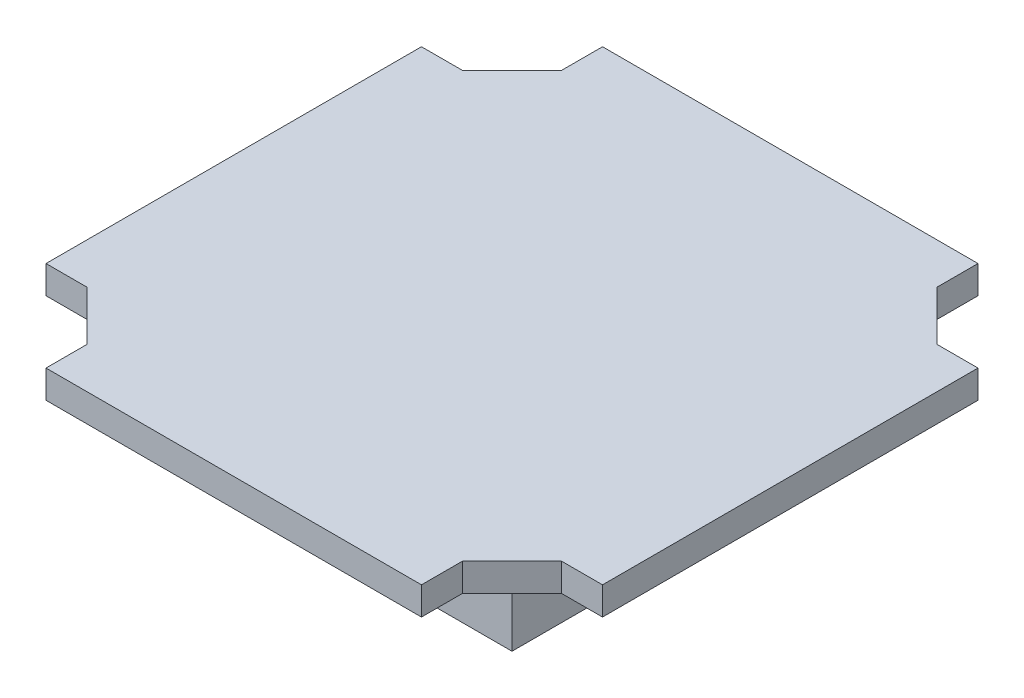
ISO-10303-21;
HEADER;
FILE_DESCRIPTION(('STEP AP214'),'2;1');
FILE_NAME('part.step','',(''),(''),'','','');
FILE_SCHEMA(('AUTOMOTIVE_DESIGN { 1 0 10303 214 1 1 1 1 }'));
ENDSEC;
DATA;
#1=APPLICATION_CONTEXT('core data for automotive mechanical design processes');
#2=APPLICATION_PROTOCOL_DEFINITION('international standard','automotive_design',2000,#1);
#3=PRODUCT_CONTEXT('',#1,'mechanical');
#4=PRODUCT('Part','Part','',(#3));
#5=PRODUCT_RELATED_PRODUCT_CATEGORY('part','',(#4));
#6=PRODUCT_DEFINITION_FORMATION('','',#4);
#7=PRODUCT_DEFINITION_CONTEXT('part definition',#1,'design');
#8=PRODUCT_DEFINITION('design','',#6,#7);
#9=PRODUCT_DEFINITION_SHAPE('','',#8);
#10=(LENGTH_UNIT() NAMED_UNIT(*) SI_UNIT(.MILLI.,.METRE.));
#11=(NAMED_UNIT(*) PLANE_ANGLE_UNIT() SI_UNIT($,.RADIAN.));
#12=(NAMED_UNIT(*) SI_UNIT($,.STERADIAN.) SOLID_ANGLE_UNIT());
#13=UNCERTAINTY_MEASURE_WITH_UNIT(LENGTH_MEASURE(1.E-05),#10,'distance_accuracy_value','');
#14=(GEOMETRIC_REPRESENTATION_CONTEXT(3) GLOBAL_UNCERTAINTY_ASSIGNED_CONTEXT((#13)) GLOBAL_UNIT_ASSIGNED_CONTEXT((#10,
#11,#12)) REPRESENTATION_CONTEXT('',''));
#15=CARTESIAN_POINT('',(0.,0.,0.));
#16=DIRECTION('',(0.,0.,1.));
#17=DIRECTION('',(1.,0.,0.));
#18=AXIS2_PLACEMENT_3D('',#15,#16,#17);
#19=CARTESIAN_POINT('',(-19.0196847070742,2.5,19.0196847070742));
#20=DIRECTION('',(0.707106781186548,0.,-0.707106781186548));
#21=DIRECTION('',(-0.707106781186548,0.,-0.707106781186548));
#22=AXIS2_PLACEMENT_3D('',#19,#20,#21);
#23=PLANE('',#22);
#24=DIRECTION('',(0.707106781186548,0.,0.707106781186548));
#25=VECTOR('',#24,1.);
#26=CARTESIAN_POINT('',(-19.0196847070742,0.,19.0196847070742));
#27=LINE('',#26,#25);
#28=CARTESIAN_POINT('',(-21.24,0.,16.7993694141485));
#29=VERTEX_POINT('',#28);
#30=CARTESIAN_POINT('',(-16.7993694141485,0.,21.24));
#31=VERTEX_POINT('',#30);
#32=EDGE_CURVE('E779',#29,#31,#27,.T.);
#33=ORIENTED_EDGE('',*,*,#32,.T.);
#34=DIRECTION('',(0.,-1.,0.));
#35=VECTOR('',#34,1.);
#36=CARTESIAN_POINT('',(-16.7993694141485,2.5,21.24));
#37=LINE('',#36,#35);
#38=CARTESIAN_POINT('',(-16.7993694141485,2.5,21.24));
#39=VERTEX_POINT('',#38);
#40=EDGE_CURVE('E12',#39,#31,#37,.T.);
#41=ORIENTED_EDGE('',*,*,#40,.F.);
#42=DIRECTION('',(0.707106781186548,0.,0.707106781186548));
#43=VECTOR('',#42,1.);
#44=CARTESIAN_POINT('',(-19.0196847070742,2.5,19.0196847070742));
#45=LINE('',#44,#43);
#46=CARTESIAN_POINT('',(-21.24,2.5,16.7993694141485));
#47=VERTEX_POINT('',#46);
#48=EDGE_CURVE('E790',#47,#39,#45,.T.);
#49=ORIENTED_EDGE('',*,*,#48,.F.);
#50=DIRECTION('',(0.,-1.,0.));
#51=VECTOR('',#50,1.);
#52=CARTESIAN_POINT('',(-21.24,2.5,16.7993694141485));
#53=LINE('',#52,#51);
#54=EDGE_CURVE('E842',#47,#29,#53,.T.);
#55=ORIENTED_EDGE('',*,*,#54,.T.);
#56=EDGE_LOOP('',(#33,#41,#49,#55));
#57=FACE_BOUND('',#56,.T.);
#58=ADVANCED_FACE('F221',(#57),#23,.F.);
#59=CARTESIAN_POINT('',(-16.7993694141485,2.5,0.));
#60=DIRECTION('',(1.,0.,0.));
#61=DIRECTION('',(0.,0.,-1.));
#62=AXIS2_PLACEMENT_3D('',#59,#60,#61);
#63=PLANE('',#62);
#64=DIRECTION('',(0.,0.,1.));
#65=VECTOR('',#64,1.);
#66=CARTESIAN_POINT('',(-16.7993694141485,0.,0.));
#67=LINE('',#66,#65);
#68=CARTESIAN_POINT('',(-16.7993694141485,0.,24.9));
#69=VERTEX_POINT('',#68);
#70=EDGE_CURVE('E846',#31,#69,#67,.T.);
#71=ORIENTED_EDGE('',*,*,#70,.T.);
#72=DIRECTION('',(0.,-1.,0.));
#73=VECTOR('',#72,1.);
#74=CARTESIAN_POINT('',(-16.7993694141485,2.5,24.9));
#75=LINE('',#74,#73);
#76=CARTESIAN_POINT('',(-16.7993694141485,2.5,24.9));
#77=VERTEX_POINT('',#76);
#78=EDGE_CURVE('E229',#77,#69,#75,.T.);
#79=ORIENTED_EDGE('',*,*,#78,.F.);
#80=DIRECTION('',(0.,0.,1.));
#81=VECTOR('',#80,1.);
#82=CARTESIAN_POINT('',(-16.7993694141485,2.5,0.));
#83=LINE('',#82,#81);
#84=EDGE_CURVE('E794',#39,#77,#83,.T.);
#85=ORIENTED_EDGE('',*,*,#84,.F.);
#86=ORIENTED_EDGE('',*,*,#40,.T.);
#87=EDGE_LOOP('',(#71,#79,#85,#86));
#88=FACE_BOUND('',#87,.T.);
#89=ADVANCED_FACE('F973',(#88),#63,.F.);
#90=CARTESIAN_POINT('',(0.,2.5,24.9));
#91=DIRECTION('',(0.,0.,-1.));
#92=DIRECTION('',(-1.,0.,0.));
#93=AXIS2_PLACEMENT_3D('',#90,#91,#92);
#94=PLANE('',#93);
#95=DIRECTION('',(1.,0.,0.));
#96=VECTOR('',#95,1.);
#97=CARTESIAN_POINT('',(0.,0.,24.9));
#98=LINE('',#97,#96);
#99=CARTESIAN_POINT('',(16.7993694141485,0.,24.9));
#100=VERTEX_POINT('',#99);
#101=EDGE_CURVE('E849',#69,#100,#98,.T.);
#102=ORIENTED_EDGE('',*,*,#101,.T.);
#103=DIRECTION('',(0.,-1.,0.));
#104=VECTOR('',#103,1.);
#105=CARTESIAN_POINT('',(16.7993694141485,2.5,24.9));
#106=LINE('',#105,#104);
#107=CARTESIAN_POINT('',(16.7993694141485,2.5,24.9));
#108=VERTEX_POINT('',#107);
#109=EDGE_CURVE('E941',#108,#100,#106,.T.);
#110=ORIENTED_EDGE('',*,*,#109,.F.);
#111=DIRECTION('',(1.,0.,0.));
#112=VECTOR('',#111,1.);
#113=CARTESIAN_POINT('',(0.,2.5,24.9));
#114=LINE('',#113,#112);
#115=EDGE_CURVE('E798',#77,#108,#114,.T.);
#116=ORIENTED_EDGE('',*,*,#115,.F.);
#117=ORIENTED_EDGE('',*,*,#78,.T.);
#118=EDGE_LOOP('',(#102,#110,#116,#117));
#119=FACE_BOUND('',#118,.T.);
#120=ADVANCED_FACE('F950',(#119),#94,.F.);
#121=CARTESIAN_POINT('',(16.7993694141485,2.5,0.));
#122=DIRECTION('',(-1.,0.,0.));
#123=DIRECTION('',(0.,0.,1.));
#124=AXIS2_PLACEMENT_3D('',#121,#122,#123);
#125=PLANE('',#124);
#126=DIRECTION('',(0.,0.,-1.));
#127=VECTOR('',#126,1.);
#128=CARTESIAN_POINT('',(16.7993694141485,0.,0.));
#129=LINE('',#128,#127);
#130=CARTESIAN_POINT('',(16.7993694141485,0.,21.24));
#131=VERTEX_POINT('',#130);
#132=EDGE_CURVE('E852',#100,#131,#129,.T.);
#133=ORIENTED_EDGE('',*,*,#132,.T.);
#134=DIRECTION('',(0.,-1.,0.));
#135=VECTOR('',#134,1.);
#136=CARTESIAN_POINT('',(16.7993694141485,2.5,21.24));
#137=LINE('',#136,#135);
#138=CARTESIAN_POINT('',(16.7993694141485,2.5,21.24));
#139=VERTEX_POINT('',#138);
#140=EDGE_CURVE('E937',#139,#131,#137,.T.);
#141=ORIENTED_EDGE('',*,*,#140,.F.);
#142=DIRECTION('',(0.,0.,-1.));
#143=VECTOR('',#142,1.);
#144=CARTESIAN_POINT('',(16.7993694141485,2.5,0.));
#145=LINE('',#144,#143);
#146=EDGE_CURVE('E801',#108,#139,#145,.T.);
#147=ORIENTED_EDGE('',*,*,#146,.F.);
#148=ORIENTED_EDGE('',*,*,#109,.T.);
#149=EDGE_LOOP('',(#133,#141,#147,#148));
#150=FACE_BOUND('',#149,.T.);
#151=ADVANCED_FACE('F961',(#150),#125,.F.);
#152=CARTESIAN_POINT('',(19.0196847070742,2.5,19.0196847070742));
#153=DIRECTION('',(-0.707106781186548,0.,-0.707106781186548));
#154=DIRECTION('',(-0.707106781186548,0.,0.707106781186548));
#155=AXIS2_PLACEMENT_3D('',#152,#153,#154);
#156=PLANE('',#155);
#157=DIRECTION('',(0.707106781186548,0.,-0.707106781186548));
#158=VECTOR('',#157,1.);
#159=CARTESIAN_POINT('',(19.0196847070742,0.,19.0196847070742));
#160=LINE('',#159,#158);
#161=CARTESIAN_POINT('',(21.24,0.,16.7993694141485));
#162=VERTEX_POINT('',#161);
#163=EDGE_CURVE('E855',#131,#162,#160,.T.);
#164=ORIENTED_EDGE('',*,*,#163,.T.);
#165=DIRECTION('',(0.,-1.,0.));
#166=VECTOR('',#165,1.);
#167=CARTESIAN_POINT('',(21.24,2.5,16.7993694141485));
#168=LINE('',#167,#166);
#169=CARTESIAN_POINT('',(21.24,2.5,16.7993694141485));
#170=VERTEX_POINT('',#169);
#171=EDGE_CURVE('E933',#170,#162,#168,.T.);
#172=ORIENTED_EDGE('',*,*,#171,.F.);
#173=DIRECTION('',(0.707106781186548,0.,-0.707106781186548));
#174=VECTOR('',#173,1.);
#175=CARTESIAN_POINT('',(19.0196847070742,2.5,19.0196847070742));
#176=LINE('',#175,#174);
#177=EDGE_CURVE('E804',#139,#170,#176,.T.);
#178=ORIENTED_EDGE('',*,*,#177,.F.);
#179=ORIENTED_EDGE('',*,*,#140,.T.);
#180=EDGE_LOOP('',(#164,#172,#178,#179));
#181=FACE_BOUND('',#180,.T.);
#182=ADVANCED_FACE('F965',(#181),#156,.F.);
#183=CARTESIAN_POINT('',(0.,2.5,16.7993694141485));
#184=DIRECTION('',(0.,0.,-1.));
#185=DIRECTION('',(-1.,0.,0.));
#186=AXIS2_PLACEMENT_3D('',#183,#184,#185);
#187=PLANE('',#186);
#188=DIRECTION('',(1.,0.,0.));
#189=VECTOR('',#188,1.);
#190=CARTESIAN_POINT('',(0.,0.,16.7993694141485));
#191=LINE('',#190,#189);
#192=CARTESIAN_POINT('',(24.9,0.,16.7993694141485));
#193=VERTEX_POINT('',#192);
#194=EDGE_CURVE('E858',#162,#193,#191,.T.);
#195=ORIENTED_EDGE('',*,*,#194,.T.);
#196=DIRECTION('',(0.,-1.,0.));
#197=VECTOR('',#196,1.);
#198=CARTESIAN_POINT('',(24.9,2.5,16.7993694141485));
#199=LINE('',#198,#197);
#200=CARTESIAN_POINT('',(24.9,2.5,16.7993694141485));
#201=VERTEX_POINT('',#200);
#202=EDGE_CURVE('E929',#201,#193,#199,.T.);
#203=ORIENTED_EDGE('',*,*,#202,.F.);
#204=DIRECTION('',(1.,0.,0.));
#205=VECTOR('',#204,1.);
#206=CARTESIAN_POINT('',(0.,2.5,16.7993694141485));
#207=LINE('',#206,#205);
#208=EDGE_CURVE('E807',#170,#201,#207,.T.);
#209=ORIENTED_EDGE('',*,*,#208,.F.);
#210=ORIENTED_EDGE('',*,*,#171,.T.);
#211=EDGE_LOOP('',(#195,#203,#209,#210));
#212=FACE_BOUND('',#211,.T.);
#213=ADVANCED_FACE('F1023',(#212),#187,.F.);
#214=CARTESIAN_POINT('',(24.9,2.5,0.));
#215=DIRECTION('',(-1.,0.,0.));
#216=DIRECTION('',(0.,0.,1.));
#217=AXIS2_PLACEMENT_3D('',#214,#215,#216);
#218=PLANE('',#217);
#219=DIRECTION('',(0.,0.,-1.));
#220=VECTOR('',#219,1.);
#221=CARTESIAN_POINT('',(24.9,0.,0.));
#222=LINE('',#221,#220);
#223=CARTESIAN_POINT('',(24.9,0.,-16.7993694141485));
#224=VERTEX_POINT('',#223);
#225=EDGE_CURVE('E861',#193,#224,#222,.T.);
#226=ORIENTED_EDGE('',*,*,#225,.T.);
#227=DIRECTION('',(0.,-1.,0.));
#228=VECTOR('',#227,1.);
#229=CARTESIAN_POINT('',(24.9,2.5,-16.7993694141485));
#230=LINE('',#229,#228);
#231=CARTESIAN_POINT('',(24.9,2.5,-16.7993694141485));
#232=VERTEX_POINT('',#231);
#233=EDGE_CURVE('E925',#232,#224,#230,.T.);
#234=ORIENTED_EDGE('',*,*,#233,.F.);
#235=DIRECTION('',(0.,0.,-1.));
#236=VECTOR('',#235,1.);
#237=CARTESIAN_POINT('',(24.9,2.5,0.));
#238=LINE('',#237,#236);
#239=EDGE_CURVE('E810',#201,#232,#238,.T.);
#240=ORIENTED_EDGE('',*,*,#239,.F.);
#241=ORIENTED_EDGE('',*,*,#202,.T.);
#242=EDGE_LOOP('',(#226,#234,#240,#241));
#243=FACE_BOUND('',#242,.T.);
#244=ADVANCED_FACE('F1020',(#243),#218,.F.);
#245=CARTESIAN_POINT('',(0.,2.5,-16.7993694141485));
#246=DIRECTION('',(0.,0.,1.));
#247=DIRECTION('',(1.,0.,0.));
#248=AXIS2_PLACEMENT_3D('',#245,#246,#247);
#249=PLANE('',#248);
#250=DIRECTION('',(-1.,0.,0.));
#251=VECTOR('',#250,1.);
#252=CARTESIAN_POINT('',(0.,0.,-16.7993694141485));
#253=LINE('',#252,#251);
#254=CARTESIAN_POINT('',(21.24,0.,-16.7993694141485));
#255=VERTEX_POINT('',#254);
#256=EDGE_CURVE('E864',#224,#255,#253,.T.);
#257=ORIENTED_EDGE('',*,*,#256,.T.);
#258=DIRECTION('',(0.,-1.,0.));
#259=VECTOR('',#258,1.);
#260=CARTESIAN_POINT('',(21.24,2.5,-16.7993694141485));
#261=LINE('',#260,#259);
#262=CARTESIAN_POINT('',(21.24,2.5,-16.7993694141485));
#263=VERTEX_POINT('',#262);
#264=EDGE_CURVE('E921',#263,#255,#261,.T.);
#265=ORIENTED_EDGE('',*,*,#264,.F.);
#266=DIRECTION('',(-1.,0.,0.));
#267=VECTOR('',#266,1.);
#268=CARTESIAN_POINT('',(0.,2.5,-16.7993694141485));
#269=LINE('',#268,#267);
#270=EDGE_CURVE('E813',#232,#263,#269,.T.);
#271=ORIENTED_EDGE('',*,*,#270,.F.);
#272=ORIENTED_EDGE('',*,*,#233,.T.);
#273=EDGE_LOOP('',(#257,#265,#271,#272));
#274=FACE_BOUND('',#273,.T.);
#275=ADVANCED_FACE('F1016',(#274),#249,.F.);
#276=CARTESIAN_POINT('',(19.0196847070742,2.5,-19.0196847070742));
#277=DIRECTION('',(-0.707106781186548,0.,0.707106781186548));
#278=DIRECTION('',(0.707106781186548,0.,0.707106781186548));
#279=AXIS2_PLACEMENT_3D('',#276,#277,#278);
#280=PLANE('',#279);
#281=DIRECTION('',(-0.707106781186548,0.,-0.707106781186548));
#282=VECTOR('',#281,1.);
#283=CARTESIAN_POINT('',(19.0196847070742,0.,-19.0196847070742));
#284=LINE('',#283,#282);
#285=CARTESIAN_POINT('',(16.7993694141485,0.,-21.24));
#286=VERTEX_POINT('',#285);
#287=EDGE_CURVE('E867',#255,#286,#284,.T.);
#288=ORIENTED_EDGE('',*,*,#287,.T.);
#289=DIRECTION('',(0.,-1.,0.));
#290=VECTOR('',#289,1.);
#291=CARTESIAN_POINT('',(16.7993694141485,2.5,-21.24));
#292=LINE('',#291,#290);
#293=CARTESIAN_POINT('',(16.7993694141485,2.5,-21.24));
#294=VERTEX_POINT('',#293);
#295=EDGE_CURVE('E917',#294,#286,#292,.T.);
#296=ORIENTED_EDGE('',*,*,#295,.F.);
#297=DIRECTION('',(-0.707106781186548,0.,-0.707106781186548));
#298=VECTOR('',#297,1.);
#299=CARTESIAN_POINT('',(19.0196847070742,2.5,-19.0196847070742));
#300=LINE('',#299,#298);
#301=EDGE_CURVE('E816',#263,#294,#300,.T.);
#302=ORIENTED_EDGE('',*,*,#301,.F.);
#303=ORIENTED_EDGE('',*,*,#264,.T.);
#304=EDGE_LOOP('',(#288,#296,#302,#303));
#305=FACE_BOUND('',#304,.T.);
#306=ADVANCED_FACE('F1012',(#305),#280,.F.);
#307=CARTESIAN_POINT('',(16.7993694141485,2.5,0.));
#308=DIRECTION('',(-1.,0.,0.));
#309=DIRECTION('',(0.,0.,1.));
#310=AXIS2_PLACEMENT_3D('',#307,#308,#309);
#311=PLANE('',#310);
#312=DIRECTION('',(0.,0.,-1.));
#313=VECTOR('',#312,1.);
#314=CARTESIAN_POINT('',(16.7993694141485,0.,0.));
#315=LINE('',#314,#313);
#316=CARTESIAN_POINT('',(16.7993694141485,0.,-24.9));
#317=VERTEX_POINT('',#316);
#318=EDGE_CURVE('E870',#286,#317,#315,.T.);
#319=ORIENTED_EDGE('',*,*,#318,.T.);
#320=DIRECTION('',(0.,-1.,0.));
#321=VECTOR('',#320,1.);
#322=CARTESIAN_POINT('',(16.7993694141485,2.5,-24.9));
#323=LINE('',#322,#321);
#324=CARTESIAN_POINT('',(16.7993694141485,2.5,-24.9));
#325=VERTEX_POINT('',#324);
#326=EDGE_CURVE('E914',#325,#317,#323,.T.);
#327=ORIENTED_EDGE('',*,*,#326,.F.);
#328=DIRECTION('',(0.,0.,-1.));
#329=VECTOR('',#328,1.);
#330=CARTESIAN_POINT('',(16.7993694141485,2.5,0.));
#331=LINE('',#330,#329);
#332=EDGE_CURVE('E819',#294,#325,#331,.T.);
#333=ORIENTED_EDGE('',*,*,#332,.F.);
#334=ORIENTED_EDGE('',*,*,#295,.T.);
#335=EDGE_LOOP('',(#319,#327,#333,#334));
#336=FACE_BOUND('',#335,.T.);
#337=ADVANCED_FACE('F1007',(#336),#311,.F.);
#338=CARTESIAN_POINT('',(0.,2.5,-24.9));
#339=DIRECTION('',(0.,0.,-1.));
#340=DIRECTION('',(-1.,0.,0.));
#341=AXIS2_PLACEMENT_3D('',#338,#339,#340);
#342=PLANE('',#341);
#343=DIRECTION('',(1.,0.,0.));
#344=VECTOR('',#343,1.);
#345=CARTESIAN_POINT('',(0.,0.,-24.9));
#346=LINE('',#345,#344);
#347=CARTESIAN_POINT('',(-16.7993694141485,0.,-24.9));
#348=VERTEX_POINT('',#347);
#349=EDGE_CURVE('E874',#348,#317,#346,.T.);
#350=ORIENTED_EDGE('',*,*,#349,.F.);
#351=DIRECTION('',(0.,-1.,0.));
#352=VECTOR('',#351,1.);
#353=CARTESIAN_POINT('',(-16.7993694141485,2.5,-24.9));
#354=LINE('',#353,#352);
#355=CARTESIAN_POINT('',(-16.7993694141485,2.5,-24.9));
#356=VERTEX_POINT('',#355);
#357=EDGE_CURVE('E911',#356,#348,#354,.T.);
#358=ORIENTED_EDGE('',*,*,#357,.F.);
#359=DIRECTION('',(1.,0.,0.));
#360=VECTOR('',#359,1.);
#361=CARTESIAN_POINT('',(0.,2.5,-24.9));
#362=LINE('',#361,#360);
#363=EDGE_CURVE('E822',#356,#325,#362,.T.);
#364=ORIENTED_EDGE('',*,*,#363,.T.);
#365=ORIENTED_EDGE('',*,*,#326,.T.);
#366=EDGE_LOOP('',(#350,#358,#364,#365));
#367=FACE_BOUND('',#366,.T.);
#368=ADVANCED_FACE('F1001',(#367),#342,.T.);
#369=CARTESIAN_POINT('',(-16.7993694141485,2.5,0.));
#370=DIRECTION('',(1.,0.,0.));
#371=DIRECTION('',(0.,0.,-1.));
#372=AXIS2_PLACEMENT_3D('',#369,#370,#371);
#373=PLANE('',#372);
#374=DIRECTION('',(0.,0.,1.));
#375=VECTOR('',#374,1.);
#376=CARTESIAN_POINT('',(-16.7993694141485,0.,0.));
#377=LINE('',#376,#375);
#378=CARTESIAN_POINT('',(-16.7993694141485,0.,-21.24));
#379=VERTEX_POINT('',#378);
#380=EDGE_CURVE('E878',#348,#379,#377,.T.);
#381=ORIENTED_EDGE('',*,*,#380,.T.);
#382=DIRECTION('',(0.,-1.,0.));
#383=VECTOR('',#382,1.);
#384=CARTESIAN_POINT('',(-16.7993694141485,2.5,-21.24));
#385=LINE('',#384,#383);
#386=CARTESIAN_POINT('',(-16.7993694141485,2.5,-21.24));
#387=VERTEX_POINT('',#386);
#388=EDGE_CURVE('E907',#387,#379,#385,.T.);
#389=ORIENTED_EDGE('',*,*,#388,.F.);
#390=DIRECTION('',(0.,0.,1.));
#391=VECTOR('',#390,1.);
#392=CARTESIAN_POINT('',(-16.7993694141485,2.5,0.));
#393=LINE('',#392,#391);
#394=EDGE_CURVE('E826',#356,#387,#393,.T.);
#395=ORIENTED_EDGE('',*,*,#394,.F.);
#396=ORIENTED_EDGE('',*,*,#357,.T.);
#397=EDGE_LOOP('',(#381,#389,#395,#396));
#398=FACE_BOUND('',#397,.T.);
#399=ADVANCED_FACE('F998',(#398),#373,.F.);
#400=CARTESIAN_POINT('',(-19.0196847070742,2.5,-19.0196847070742));
#401=DIRECTION('',(0.707106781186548,0.,0.707106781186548));
#402=DIRECTION('',(0.707106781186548,0.,-0.707106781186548));
#403=AXIS2_PLACEMENT_3D('',#400,#401,#402);
#404=PLANE('',#403);
#405=DIRECTION('',(-0.707106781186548,0.,0.707106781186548));
#406=VECTOR('',#405,1.);
#407=CARTESIAN_POINT('',(-19.0196847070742,0.,-19.0196847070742));
#408=LINE('',#407,#406);
#409=CARTESIAN_POINT('',(-21.24,0.,-16.7993694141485));
#410=VERTEX_POINT('',#409);
#411=EDGE_CURVE('E881',#379,#410,#408,.T.);
#412=ORIENTED_EDGE('',*,*,#411,.T.);
#413=DIRECTION('',(0.,-1.,0.));
#414=VECTOR('',#413,1.);
#415=CARTESIAN_POINT('',(-21.24,2.5,-16.7993694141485));
#416=LINE('',#415,#414);
#417=CARTESIAN_POINT('',(-21.24,2.5,-16.7993694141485));
#418=VERTEX_POINT('',#417);
#419=EDGE_CURVE('E903',#418,#410,#416,.T.);
#420=ORIENTED_EDGE('',*,*,#419,.F.);
#421=DIRECTION('',(-0.707106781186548,0.,0.707106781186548));
#422=VECTOR('',#421,1.);
#423=CARTESIAN_POINT('',(-19.0196847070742,2.5,-19.0196847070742));
#424=LINE('',#423,#422);
#425=EDGE_CURVE('E829',#387,#418,#424,.T.);
#426=ORIENTED_EDGE('',*,*,#425,.F.);
#427=ORIENTED_EDGE('',*,*,#388,.T.);
#428=EDGE_LOOP('',(#412,#420,#426,#427));
#429=FACE_BOUND('',#428,.T.);
#430=ADVANCED_FACE('F993',(#429),#404,.F.);
#431=CARTESIAN_POINT('',(0.,2.5,-16.7993694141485));
#432=DIRECTION('',(0.,0.,1.));
#433=DIRECTION('',(1.,0.,0.));
#434=AXIS2_PLACEMENT_3D('',#431,#432,#433);
#435=PLANE('',#434);
#436=DIRECTION('',(-1.,0.,0.));
#437=VECTOR('',#436,1.);
#438=CARTESIAN_POINT('',(0.,0.,-16.7993694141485));
#439=LINE('',#438,#437);
#440=CARTESIAN_POINT('',(-24.9,0.,-16.7993694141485));
#441=VERTEX_POINT('',#440);
#442=EDGE_CURVE('E884',#410,#441,#439,.T.);
#443=ORIENTED_EDGE('',*,*,#442,.T.);
#444=DIRECTION('',(0.,-1.,0.));
#445=VECTOR('',#444,1.);
#446=CARTESIAN_POINT('',(-24.9,2.5,-16.7993694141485));
#447=LINE('',#446,#445);
#448=CARTESIAN_POINT('',(-24.9,2.5,-16.7993694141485));
#449=VERTEX_POINT('',#448);
#450=EDGE_CURVE('E900',#449,#441,#447,.T.);
#451=ORIENTED_EDGE('',*,*,#450,.F.);
#452=DIRECTION('',(-1.,0.,0.));
#453=VECTOR('',#452,1.);
#454=CARTESIAN_POINT('',(0.,2.5,-16.7993694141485));
#455=LINE('',#454,#453);
#456=EDGE_CURVE('E832',#418,#449,#455,.T.);
#457=ORIENTED_EDGE('',*,*,#456,.F.);
#458=ORIENTED_EDGE('',*,*,#419,.T.);
#459=EDGE_LOOP('',(#443,#451,#457,#458));
#460=FACE_BOUND('',#459,.T.);
#461=ADVANCED_FACE('F987',(#460),#435,.F.);
#462=CARTESIAN_POINT('',(-24.9,2.5,0.));
#463=DIRECTION('',(-1.,0.,0.));
#464=DIRECTION('',(0.,0.,1.));
#465=AXIS2_PLACEMENT_3D('',#462,#463,#464);
#466=PLANE('',#465);
#467=DIRECTION('',(0.,0.,-1.));
#468=VECTOR('',#467,1.);
#469=CARTESIAN_POINT('',(-24.9,0.,0.));
#470=LINE('',#469,#468);
#471=CARTESIAN_POINT('',(-24.9,0.,16.7993694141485));
#472=VERTEX_POINT('',#471);
#473=EDGE_CURVE('E888',#472,#441,#470,.T.);
#474=ORIENTED_EDGE('',*,*,#473,.F.);
#475=DIRECTION('',(0.,-1.,0.));
#476=VECTOR('',#475,1.);
#477=CARTESIAN_POINT('',(-24.9,2.5,16.7993694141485));
#478=LINE('',#477,#476);
#479=CARTESIAN_POINT('',(-24.9,2.5,16.7993694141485));
#480=VERTEX_POINT('',#479);
#481=EDGE_CURVE('E897',#480,#472,#478,.T.);
#482=ORIENTED_EDGE('',*,*,#481,.F.);
#483=DIRECTION('',(0.,0.,-1.));
#484=VECTOR('',#483,1.);
#485=CARTESIAN_POINT('',(-24.9,2.5,0.));
#486=LINE('',#485,#484);
#487=EDGE_CURVE('E835',#480,#449,#486,.T.);
#488=ORIENTED_EDGE('',*,*,#487,.T.);
#489=ORIENTED_EDGE('',*,*,#450,.T.);
#490=EDGE_LOOP('',(#474,#482,#488,#489));
#491=FACE_BOUND('',#490,.T.);
#492=ADVANCED_FACE('F981',(#491),#466,.T.);
#493=CARTESIAN_POINT('',(0.,2.5,16.7993694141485));
#494=DIRECTION('',(0.,0.,-1.));
#495=DIRECTION('',(-1.,0.,0.));
#496=AXIS2_PLACEMENT_3D('',#493,#494,#495);
#497=PLANE('',#496);
#498=DIRECTION('',(1.,0.,0.));
#499=VECTOR('',#498,1.);
#500=CARTESIAN_POINT('',(0.,0.,16.7993694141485));
#501=LINE('',#500,#499);
#502=EDGE_CURVE('E795',#472,#29,#501,.T.);
#503=ORIENTED_EDGE('',*,*,#502,.T.);
#504=ORIENTED_EDGE('',*,*,#54,.F.);
#505=DIRECTION('',(1.,0.,0.));
#506=VECTOR('',#505,1.);
#507=CARTESIAN_POINT('',(0.,2.5,16.7993694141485));
#508=LINE('',#507,#506);
#509=EDGE_CURVE('E839',#480,#47,#508,.T.);
#510=ORIENTED_EDGE('',*,*,#509,.F.);
#511=ORIENTED_EDGE('',*,*,#481,.T.);
#512=EDGE_LOOP('',(#503,#504,#510,#511));
#513=FACE_BOUND('',#512,.T.);
#514=ADVANCED_FACE('F1125',(#513),#497,.F.);
#515=CARTESIAN_POINT('',(0.,2.5,0.));
#516=DIRECTION('',(0.,1.,0.));
#517=DIRECTION('',(0.,0.,1.));
#518=AXIS2_PLACEMENT_3D('',#515,#516,#517);
#519=PLANE('',#518);
#520=ORIENTED_EDGE('',*,*,#48,.T.);
#521=ORIENTED_EDGE('',*,*,#84,.T.);
#522=ORIENTED_EDGE('',*,*,#115,.T.);
#523=ORIENTED_EDGE('',*,*,#146,.T.);
#524=ORIENTED_EDGE('',*,*,#177,.T.);
#525=ORIENTED_EDGE('',*,*,#208,.T.);
#526=ORIENTED_EDGE('',*,*,#239,.T.);
#527=ORIENTED_EDGE('',*,*,#270,.T.);
#528=ORIENTED_EDGE('',*,*,#301,.T.);
#529=ORIENTED_EDGE('',*,*,#332,.T.);
#530=ORIENTED_EDGE('',*,*,#363,.F.);
#531=ORIENTED_EDGE('',*,*,#394,.T.);
#532=ORIENTED_EDGE('',*,*,#425,.T.);
#533=ORIENTED_EDGE('',*,*,#456,.T.);
#534=ORIENTED_EDGE('',*,*,#487,.F.);
#535=ORIENTED_EDGE('',*,*,#509,.T.);
#536=EDGE_LOOP('',(#520,#521,#522,#523,#524,#525,#526,#527,#528,#529,#530,#531,#532,#533,#534,#535));
#537=FACE_BOUND('',#536,.T.);
#538=ADVANCED_FACE('F969',(#537),#519,.T.);
#539=CARTESIAN_POINT('',(0.,0.,0.));
#540=DIRECTION('',(0.,1.,0.));
#541=DIRECTION('',(0.,0.,1.));
#542=AXIS2_PLACEMENT_3D('',#539,#540,#541);
#543=PLANE('',#542);
#544=DIRECTION('',(0.,0.,-1.));
#545=VECTOR('',#544,1.);
#546=CARTESIAN_POINT('',(-16.5,0.,16.5));
#547=LINE('',#546,#545);
#548=CARTESIAN_POINT('',(-16.5,0.,16.5));
#549=VERTEX_POINT('',#548);
#550=CARTESIAN_POINT('',(-16.5,0.,-16.5));
#551=VERTEX_POINT('',#550);
#552=EDGE_CURVE('E752',#549,#551,#547,.T.);
#553=ORIENTED_EDGE('',*,*,#552,.F.);
#554=DIRECTION('',(1.,0.,0.));
#555=VECTOR('',#554,1.);
#556=CARTESIAN_POINT('',(-16.5,0.,16.5));
#557=LINE('',#556,#555);
#558=CARTESIAN_POINT('',(16.5,0.,16.5));
#559=VERTEX_POINT('',#558);
#560=EDGE_CURVE('E244',#549,#559,#557,.T.);
#561=ORIENTED_EDGE('',*,*,#560,.T.);
#562=DIRECTION('',(0.,0.,-1.));
#563=VECTOR('',#562,1.);
#564=CARTESIAN_POINT('',(16.5,0.,16.5));
#565=LINE('',#564,#563);
#566=CARTESIAN_POINT('',(16.5,0.,-16.5));
#567=VERTEX_POINT('',#566);
#568=EDGE_CURVE('E765',#559,#567,#565,.T.);
#569=ORIENTED_EDGE('',*,*,#568,.T.);
#570=DIRECTION('',(1.,0.,0.));
#571=VECTOR('',#570,1.);
#572=CARTESIAN_POINT('',(-16.5,0.,-16.5));
#573=LINE('',#572,#571);
#574=EDGE_CURVE('E768',#551,#567,#573,.T.);
#575=ORIENTED_EDGE('',*,*,#574,.F.);
#576=EDGE_LOOP('',(#553,#561,#569,#575));
#577=FACE_BOUND('',#576,.T.);
#578=ORIENTED_EDGE('',*,*,#32,.F.);
#579=ORIENTED_EDGE('',*,*,#502,.F.);
#580=ORIENTED_EDGE('',*,*,#473,.T.);
#581=ORIENTED_EDGE('',*,*,#442,.F.);
#582=ORIENTED_EDGE('',*,*,#411,.F.);
#583=ORIENTED_EDGE('',*,*,#380,.F.);
#584=ORIENTED_EDGE('',*,*,#349,.T.);
#585=ORIENTED_EDGE('',*,*,#318,.F.);
#586=ORIENTED_EDGE('',*,*,#287,.F.);
#587=ORIENTED_EDGE('',*,*,#256,.F.);
#588=ORIENTED_EDGE('',*,*,#225,.F.);
#589=ORIENTED_EDGE('',*,*,#194,.F.);
#590=ORIENTED_EDGE('',*,*,#163,.F.);
#591=ORIENTED_EDGE('',*,*,#132,.F.);
#592=ORIENTED_EDGE('',*,*,#101,.F.);
#593=ORIENTED_EDGE('',*,*,#70,.F.);
#594=EDGE_LOOP('',(#578,#579,#580,#581,#582,#583,#584,#585,#586,#587,#588,#589,#590,#591,#592,#593));
#595=FACE_BOUND('',#594,.T.);
#596=ADVANCED_FACE('F956',(#577,#595),#543,.F.);
#597=CARTESIAN_POINT('',(-16.5,-7.,16.5));
#598=DIRECTION('',(0.,0.,1.));
#599=DIRECTION('',(1.,0.,0.));
#600=AXIS2_PLACEMENT_3D('',#597,#598,#599);
#601=PLANE('',#600);
#602=ORIENTED_EDGE('',*,*,#560,.F.);
#603=DIRECTION('',(0.,1.,0.));
#604=VECTOR('',#603,1.);
#605=CARTESIAN_POINT('',(-16.5,-7.,16.5));
#606=LINE('',#605,#604);
#607=CARTESIAN_POINT('',(-16.5,-7.,16.5));
#608=VERTEX_POINT('',#607);
#609=EDGE_CURVE('E775',#608,#549,#606,.T.);
#610=ORIENTED_EDGE('',*,*,#609,.F.);
#611=DIRECTION('',(1.,0.,0.));
#612=VECTOR('',#611,1.);
#613=CARTESIAN_POINT('',(-16.5,-7.,16.5));
#614=LINE('',#613,#612);
#615=CARTESIAN_POINT('',(16.5,-7.,16.5));
#616=VERTEX_POINT('',#615);
#617=EDGE_CURVE('E747',#608,#616,#614,.T.);
#618=ORIENTED_EDGE('',*,*,#617,.T.);
#619=DIRECTION('',(0.,1.,0.));
#620=VECTOR('',#619,1.);
#621=CARTESIAN_POINT('',(16.5,-7.,16.5));
#622=LINE('',#621,#620);
#623=EDGE_CURVE('E762',#616,#559,#622,.T.);
#624=ORIENTED_EDGE('',*,*,#623,.T.);
#625=EDGE_LOOP('',(#602,#610,#618,#624));
#626=FACE_BOUND('',#625,.T.);
#627=ADVANCED_FACE('F1150',(#626),#601,.T.);
#628=CARTESIAN_POINT('',(-16.5,-7.,16.5));
#629=DIRECTION('',(1.,0.,0.));
#630=DIRECTION('',(0.,0.,-1.));
#631=AXIS2_PLACEMENT_3D('',#628,#629,#630);
#632=PLANE('',#631);
#633=ORIENTED_EDGE('',*,*,#552,.T.);
#634=DIRECTION('',(0.,1.,0.));
#635=VECTOR('',#634,1.);
#636=CARTESIAN_POINT('',(-16.5,-7.,-16.5));
#637=LINE('',#636,#635);
#638=CARTESIAN_POINT('',(-16.5,-7.,-16.5));
#639=VERTEX_POINT('',#638);
#640=EDGE_CURVE('E780',#639,#551,#637,.T.);
#641=ORIENTED_EDGE('',*,*,#640,.F.);
#642=DIRECTION('',(0.,0.,-1.));
#643=VECTOR('',#642,1.);
#644=CARTESIAN_POINT('',(-16.5,-7.,16.5));
#645=LINE('',#644,#643);
#646=EDGE_CURVE('E759',#608,#639,#645,.T.);
#647=ORIENTED_EDGE('',*,*,#646,.F.);
#648=ORIENTED_EDGE('',*,*,#609,.T.);
#649=EDGE_LOOP('',(#633,#641,#647,#648));
#650=FACE_BOUND('',#649,.T.);
#651=ADVANCED_FACE('F1159',(#650),#632,.F.);
#652=CARTESIAN_POINT('',(-16.5,-7.,-16.5));
#653=DIRECTION('',(0.,0.,1.));
#654=DIRECTION('',(1.,0.,0.));
#655=AXIS2_PLACEMENT_3D('',#652,#653,#654);
#656=PLANE('',#655);
#657=ORIENTED_EDGE('',*,*,#574,.T.);
#658=DIRECTION('',(0.,1.,0.));
#659=VECTOR('',#658,1.);
#660=CARTESIAN_POINT('',(16.5,-7.,-16.5));
#661=LINE('',#660,#659);
#662=CARTESIAN_POINT('',(16.5,-7.,-16.5));
#663=VERTEX_POINT('',#662);
#664=EDGE_CURVE('E784',#663,#567,#661,.T.);
#665=ORIENTED_EDGE('',*,*,#664,.F.);
#666=DIRECTION('',(1.,0.,0.));
#667=VECTOR('',#666,1.);
#668=CARTESIAN_POINT('',(-16.5,-7.,-16.5));
#669=LINE('',#668,#667);
#670=EDGE_CURVE('E756',#639,#663,#669,.T.);
#671=ORIENTED_EDGE('',*,*,#670,.F.);
#672=ORIENTED_EDGE('',*,*,#640,.T.);
#673=EDGE_LOOP('',(#657,#665,#671,#672));
#674=FACE_BOUND('',#673,.T.);
#675=ADVANCED_FACE('F1169',(#674),#656,.F.);
#676=CARTESIAN_POINT('',(16.5,-7.,16.5));
#677=DIRECTION('',(1.,0.,0.));
#678=DIRECTION('',(0.,0.,-1.));
#679=AXIS2_PLACEMENT_3D('',#676,#677,#678);
#680=PLANE('',#679);
#681=ORIENTED_EDGE('',*,*,#568,.F.);
#682=ORIENTED_EDGE('',*,*,#623,.F.);
#683=DIRECTION('',(0.,0.,-1.));
#684=VECTOR('',#683,1.);
#685=CARTESIAN_POINT('',(16.5,-7.,16.5));
#686=LINE('',#685,#684);
#687=EDGE_CURVE('E751',#616,#663,#686,.T.);
#688=ORIENTED_EDGE('',*,*,#687,.T.);
#689=ORIENTED_EDGE('',*,*,#664,.T.);
#690=EDGE_LOOP('',(#681,#682,#688,#689));
#691=FACE_BOUND('',#690,.T.);
#692=ADVANCED_FACE('F1179',(#691),#680,.T.);
#693=CARTESIAN_POINT('',(0.,-7.,0.));
#694=DIRECTION('',(0.,1.,0.));
#695=DIRECTION('',(0.,0.,1.));
#696=AXIS2_PLACEMENT_3D('',#693,#694,#695);
#697=PLANE('',#696);
#698=DIRECTION('',(0.707106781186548,0.,0.707106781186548));
#699=VECTOR('',#698,1.);
#700=CARTESIAN_POINT('',(-12.7279220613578,-7.,-12.0208152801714));
#701=LINE('',#700,#699);
#702=CARTESIAN_POINT('',(-12.7279220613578,-7.,-12.0208152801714));
#703=VERTEX_POINT('',#702);
#704=CARTESIAN_POINT('',(0.79289321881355,-7.,1.5));
#705=VERTEX_POINT('',#704);
#706=EDGE_CURVE('E687',#703,#705,#701,.T.);
#707=ORIENTED_EDGE('',*,*,#706,.T.);
#708=DIRECTION('',(1.,0.,0.));
#709=VECTOR('',#708,1.);
#710=CARTESIAN_POINT('',(-9.49999999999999,-7.,1.5));
#711=LINE('',#710,#709);
#712=CARTESIAN_POINT('',(-9.49999999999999,-7.,1.5));
#713=VERTEX_POINT('',#712);
#714=EDGE_CURVE('E621',#713,#705,#711,.T.);
#715=ORIENTED_EDGE('',*,*,#714,.F.);
#716=DIRECTION('',(0.,0.,-1.));
#717=VECTOR('',#716,1.);
#718=CARTESIAN_POINT('',(-9.49999999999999,-7.,4.5));
#719=LINE('',#718,#717);
#720=CARTESIAN_POINT('',(-9.49999999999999,-7.,0.5));
#721=VERTEX_POINT('',#720);
#722=EDGE_CURVE('E665',#713,#721,#719,.T.);
#723=ORIENTED_EDGE('',*,*,#722,.T.);
#724=DIRECTION('',(-0.832050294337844,0.,0.554700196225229));
#725=VECTOR('',#724,1.);
#726=CARTESIAN_POINT('',(-9.49999999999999,-7.,0.5));
#727=LINE('',#726,#725);
#728=CARTESIAN_POINT('',(-12.5,-7.,2.5));
#729=VERTEX_POINT('',#728);
#730=EDGE_CURVE('E664',#721,#729,#727,.T.);
#731=ORIENTED_EDGE('',*,*,#730,.T.);
#732=DIRECTION('',(0.832050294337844,0.,0.554700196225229));
#733=VECTOR('',#732,1.);
#734=CARTESIAN_POINT('',(-12.5,-7.,2.5));
#735=LINE('',#734,#733);
#736=CARTESIAN_POINT('',(-9.49999999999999,-7.,4.5));
#737=VERTEX_POINT('',#736);
#738=EDGE_CURVE('E669',#729,#737,#735,.T.);
#739=ORIENTED_EDGE('',*,*,#738,.T.);
#740=CARTESIAN_POINT('',(-9.49999999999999,-7.,3.5));
#741=VERTEX_POINT('',#740);
#742=EDGE_CURVE('E660',#737,#741,#719,.T.);
#743=ORIENTED_EDGE('',*,*,#742,.T.);
#744=DIRECTION('',(1.,0.,0.));
#745=VECTOR('',#744,1.);
#746=CARTESIAN_POINT('',(-9.49999999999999,-7.,3.5));
#747=LINE('',#746,#745);
#748=CARTESIAN_POINT('',(2.79289321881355,-7.,3.5));
#749=VERTEX_POINT('',#748);
#750=EDGE_CURVE('E631',#741,#749,#747,.T.);
#751=ORIENTED_EDGE('',*,*,#750,.T.);
#752=CARTESIAN_POINT('',(12.0208152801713,-7.,12.7279220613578));
#753=VERTEX_POINT('',#752);
#754=EDGE_CURVE('E716',#749,#753,#701,.T.);
#755=ORIENTED_EDGE('',*,*,#754,.T.);
#756=DIRECTION('',(0.707106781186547,0.,-0.707106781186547));
#757=VECTOR('',#756,1.);
#758=CARTESIAN_POINT('',(12.0208152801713,-7.,12.7279220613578));
#759=LINE('',#758,#757);
#760=CARTESIAN_POINT('',(12.7279220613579,-7.,12.0208152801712));
#761=VERTEX_POINT('',#760);
#762=EDGE_CURVE('E711',#753,#761,#759,.T.);
#763=ORIENTED_EDGE('',*,*,#762,.T.);
#764=DIRECTION('',(0.707106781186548,0.,0.707106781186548));
#765=VECTOR('',#764,1.);
#766=CARTESIAN_POINT('',(-12.0208152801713,-7.,-12.7279220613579));
#767=LINE('',#766,#765);
#768=CARTESIAN_POINT('',(4.20710678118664,-7.,3.5));
#769=VERTEX_POINT('',#768);
#770=EDGE_CURVE('E706',#769,#761,#767,.T.);
#771=ORIENTED_EDGE('',*,*,#770,.F.);
#772=CARTESIAN_POINT('',(12.5,-7.,3.5));
#773=VERTEX_POINT('',#772);
#774=EDGE_CURVE('E630',#769,#773,#747,.T.);
#775=ORIENTED_EDGE('',*,*,#774,.T.);
#776=DIRECTION('',(0.,0.,-1.));
#777=VECTOR('',#776,1.);
#778=CARTESIAN_POINT('',(12.5,-7.,3.5));
#779=LINE('',#778,#777);
#780=CARTESIAN_POINT('',(12.5,-7.,1.5));
#781=VERTEX_POINT('',#780);
#782=EDGE_CURVE('E625',#773,#781,#779,.T.);
#783=ORIENTED_EDGE('',*,*,#782,.T.);
#784=CARTESIAN_POINT('',(2.20710678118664,-7.,1.5));
#785=VERTEX_POINT('',#784);
#786=EDGE_CURVE('E626',#785,#781,#711,.T.);
#787=ORIENTED_EDGE('',*,*,#786,.F.);
#788=CARTESIAN_POINT('',(0.707106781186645,-7.,0.));
#789=VERTEX_POINT('',#788);
#790=EDGE_CURVE('E712',#789,#785,#767,.T.);
#791=ORIENTED_EDGE('',*,*,#790,.F.);
#792=DIRECTION('',(1.,0.,0.));
#793=VECTOR('',#792,1.);
#794=CARTESIAN_POINT('',(0.,-7.,0.));
#795=LINE('',#794,#793);
#796=CARTESIAN_POINT('',(9.50000000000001,-7.,0.));
#797=VERTEX_POINT('',#796);
#798=EDGE_CURVE('E540',#789,#797,#795,.T.);
#799=ORIENTED_EDGE('',*,*,#798,.T.);
#800=DIRECTION('',(0.,0.,-1.));
#801=VECTOR('',#800,1.);
#802=CARTESIAN_POINT('',(9.50000000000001,-7.,0.999999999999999));
#803=LINE('',#802,#801);
#804=CARTESIAN_POINT('',(9.50000000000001,-7.,0.999999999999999));
#805=VERTEX_POINT('',#804);
#806=EDGE_CURVE('E575',#805,#797,#803,.T.);
#807=ORIENTED_EDGE('',*,*,#806,.F.);
#808=DIRECTION('',(-0.832050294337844,0.,0.554700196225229));
#809=VECTOR('',#808,1.);
#810=CARTESIAN_POINT('',(12.5,-7.,-1.));
#811=LINE('',#810,#809);
#812=CARTESIAN_POINT('',(12.5,-7.,-1.));
#813=VERTEX_POINT('',#812);
#814=EDGE_CURVE('E589',#813,#805,#811,.T.);
#815=ORIENTED_EDGE('',*,*,#814,.F.);
#816=DIRECTION('',(0.832050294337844,0.,0.554700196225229));
#817=VECTOR('',#816,1.);
#818=CARTESIAN_POINT('',(9.50000000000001,-7.,-3.));
#819=LINE('',#818,#817);
#820=CARTESIAN_POINT('',(9.50000000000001,-7.,-3.));
#821=VERTEX_POINT('',#820);
#822=EDGE_CURVE('E585',#821,#813,#819,.T.);
#823=ORIENTED_EDGE('',*,*,#822,.F.);
#824=CARTESIAN_POINT('',(9.50000000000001,-7.,-2.));
#825=VERTEX_POINT('',#824);
#826=EDGE_CURVE('E594',#825,#821,#803,.T.);
#827=ORIENTED_EDGE('',*,*,#826,.F.);
#828=DIRECTION('',(1.,0.,0.));
#829=VECTOR('',#828,1.);
#830=CARTESIAN_POINT('',(0.70710678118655,-7.,-2.));
#831=LINE('',#830,#829);
#832=CARTESIAN_POINT('',(2.,-7.,-2.));
#833=VERTEX_POINT('',#832);
#834=EDGE_CURVE('E561',#833,#825,#831,.T.);
#835=ORIENTED_EDGE('',*,*,#834,.F.);
#836=DIRECTION('',(0.,0.,-1.));
#837=VECTOR('',#836,1.);
#838=CARTESIAN_POINT('',(2.,-7.,0.));
#839=LINE('',#838,#837);
#840=CARTESIAN_POINT('',(2.,-7.,-12.5));
#841=VERTEX_POINT('',#840);
#842=EDGE_CURVE('E236',#833,#841,#839,.T.);
#843=ORIENTED_EDGE('',*,*,#842,.T.);
#844=DIRECTION('',(1.,0.,0.));
#845=VECTOR('',#844,1.);
#846=CARTESIAN_POINT('',(0.,-7.,-12.5));
#847=LINE('',#846,#845);
#848=CARTESIAN_POINT('',(0.,-7.,-12.5));
#849=VERTEX_POINT('',#848);
#850=EDGE_CURVE('E524',#849,#841,#847,.T.);
#851=ORIENTED_EDGE('',*,*,#850,.F.);
#852=DIRECTION('',(0.,0.,-1.));
#853=VECTOR('',#852,1.);
#854=CARTESIAN_POINT('',(0.,-7.,0.));
#855=LINE('',#854,#853);
#856=CARTESIAN_POINT('',(0.,-7.,-0.707106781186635));
#857=VERTEX_POINT('',#856);
#858=EDGE_CURVE('E549',#857,#849,#855,.T.);
#859=ORIENTED_EDGE('',*,*,#858,.F.);
#860=CARTESIAN_POINT('',(-12.0208152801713,-7.,-12.7279220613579));
#861=VERTEX_POINT('',#860);
#862=EDGE_CURVE('E707',#861,#857,#767,.T.);
#863=ORIENTED_EDGE('',*,*,#862,.F.);
#864=DIRECTION('',(0.707106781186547,0.,-0.707106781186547));
#865=VECTOR('',#864,1.);
#866=CARTESIAN_POINT('',(-12.7279220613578,-7.,-12.0208152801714));
#867=LINE('',#866,#865);
#868=EDGE_CURVE('E702',#703,#861,#867,.T.);
#869=ORIENTED_EDGE('',*,*,#868,.F.);
#870=EDGE_LOOP('',(#707,#715,#723,#731,#739,#743,#751,#755,#763,#771,#775,#783,#787,#791,#799,
#807,#815,#823,#827,#835,#843,#851,#859,#863,#869));
#871=FACE_BOUND('',#870,.T.);
#872=ORIENTED_EDGE('',*,*,#617,.F.);
#873=ORIENTED_EDGE('',*,*,#646,.T.);
#874=ORIENTED_EDGE('',*,*,#670,.T.);
#875=ORIENTED_EDGE('',*,*,#687,.F.);
#876=EDGE_LOOP('',(#872,#873,#874,#875));
#877=FACE_BOUND('',#876,.T.);
#878=ADVANCED_FACE('F1189',(#871,#877),#697,.F.);
#879=CARTESIAN_POINT('',(0.,-6.75,0.));
#880=DIRECTION('',(0.,0.,-1.));
#881=DIRECTION('',(-1.,0.,0.));
#882=AXIS2_PLACEMENT_3D('',#879,#880,#881);
#883=PLANE('',#882);
#884=DIRECTION('',(1.,0.,0.));
#885=VECTOR('',#884,1.);
#886=CARTESIAN_POINT('',(0.,-6.75,0.));
#887=LINE('',#886,#885);
#888=CARTESIAN_POINT('',(0.707106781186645,-6.75,0.));
#889=VERTEX_POINT('',#888);
#890=CARTESIAN_POINT('',(9.50000000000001,-6.75,0.));
#891=VERTEX_POINT('',#890);
#892=EDGE_CURVE('E517',#889,#891,#887,.T.);
#893=ORIENTED_EDGE('',*,*,#892,.T.);
#894=DIRECTION('',(0.,-1.,0.));
#895=VECTOR('',#894,1.);
#896=CARTESIAN_POINT('',(9.50000000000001,-6.75,0.));
#897=LINE('',#896,#895);
#898=EDGE_CURVE('E544',#891,#797,#897,.T.);
#899=ORIENTED_EDGE('',*,*,#898,.T.);
#900=ORIENTED_EDGE('',*,*,#798,.F.);
#901=DIRECTION('',(0.,-1.,0.));
#902=VECTOR('',#901,1.);
#903=CARTESIAN_POINT('',(0.707106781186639,-6.75,0.));
#904=LINE('',#903,#902);
#905=EDGE_CURVE('E554',#889,#789,#904,.T.);
#906=ORIENTED_EDGE('',*,*,#905,.F.);
#907=EDGE_LOOP('',(#893,#899,#900,#906));
#908=FACE_BOUND('',#907,.T.);
#909=ADVANCED_FACE('F1199',(#908),#883,.T.);
#910=CARTESIAN_POINT('',(0.,-6.75,0.));
#911=DIRECTION('',(0.,1.,0.));
#912=DIRECTION('',(0.,0.,1.));
#913=AXIS2_PLACEMENT_3D('',#910,#911,#912);
#914=PLANE('',#913);
#915=DIRECTION('',(0.707106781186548,0.,0.707106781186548));
#916=VECTOR('',#915,1.);
#917=CARTESIAN_POINT('',(-12.0208152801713,-6.75,-12.7279220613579));
#918=LINE('',#917,#916);
#919=CARTESIAN_POINT('',(2.20710678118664,-6.75,1.5));
#920=VERTEX_POINT('',#919);
#921=EDGE_CURVE('E692',#889,#920,#918,.T.);
#922=ORIENTED_EDGE('',*,*,#921,.T.);
#923=DIRECTION('',(1.,0.,0.));
#924=VECTOR('',#923,1.);
#925=CARTESIAN_POINT('',(-9.49999999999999,-6.75,1.5));
#926=LINE('',#925,#924);
#927=CARTESIAN_POINT('',(12.5,-6.75,1.5));
#928=VERTEX_POINT('',#927);
#929=EDGE_CURVE('E611',#920,#928,#926,.T.);
#930=ORIENTED_EDGE('',*,*,#929,.T.);
#931=DIRECTION('',(0.,0.,-1.));
#932=VECTOR('',#931,1.);
#933=CARTESIAN_POINT('',(12.5,-6.75,3.5));
#934=LINE('',#933,#932);
#935=CARTESIAN_POINT('',(12.5,-6.75,3.5));
#936=VERTEX_POINT('',#935);
#937=EDGE_CURVE('E610',#936,#928,#934,.T.);
#938=ORIENTED_EDGE('',*,*,#937,.F.);
#939=DIRECTION('',(1.,0.,0.));
#940=VECTOR('',#939,1.);
#941=CARTESIAN_POINT('',(-9.49999999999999,-6.75,3.5));
#942=LINE('',#941,#940);
#943=CARTESIAN_POINT('',(4.20710678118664,-6.75,3.5));
#944=VERTEX_POINT('',#943);
#945=EDGE_CURVE('E615',#944,#936,#942,.T.);
#946=ORIENTED_EDGE('',*,*,#945,.F.);
#947=CARTESIAN_POINT('',(12.7279220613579,-6.75,12.0208152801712));
#948=VERTEX_POINT('',#947);
#949=EDGE_CURVE('E686',#944,#948,#918,.T.);
#950=ORIENTED_EDGE('',*,*,#949,.T.);
#951=DIRECTION('',(0.707106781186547,0.,-0.707106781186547));
#952=VECTOR('',#951,1.);
#953=CARTESIAN_POINT('',(12.0208152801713,-6.75,12.7279220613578));
#954=LINE('',#953,#952);
#955=CARTESIAN_POINT('',(12.0208152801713,-6.75,12.7279220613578));
#956=VERTEX_POINT('',#955);
#957=EDGE_CURVE('E691',#956,#948,#954,.T.);
#958=ORIENTED_EDGE('',*,*,#957,.F.);
#959=DIRECTION('',(0.707106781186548,0.,0.707106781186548));
#960=VECTOR('',#959,1.);
#961=CARTESIAN_POINT('',(-12.7279220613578,-6.75,-12.0208152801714));
#962=LINE('',#961,#960);
#963=CARTESIAN_POINT('',(2.79289321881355,-6.75,3.5));
#964=VERTEX_POINT('',#963);
#965=EDGE_CURVE('E696',#964,#956,#962,.T.);
#966=ORIENTED_EDGE('',*,*,#965,.F.);
#967=CARTESIAN_POINT('',(-9.49999999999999,-6.75,3.5));
#968=VERTEX_POINT('',#967);
#969=EDGE_CURVE('E616',#968,#964,#942,.T.);
#970=ORIENTED_EDGE('',*,*,#969,.F.);
#971=DIRECTION('',(0.,0.,-1.));
#972=VECTOR('',#971,1.);
#973=CARTESIAN_POINT('',(-9.49999999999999,-6.75,4.5));
#974=LINE('',#973,#972);
#975=CARTESIAN_POINT('',(-9.49999999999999,-6.75,4.5));
#976=VERTEX_POINT('',#975);
#977=EDGE_CURVE('E648',#976,#968,#974,.T.);
#978=ORIENTED_EDGE('',*,*,#977,.F.);
#979=DIRECTION('',(0.832050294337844,0.,0.554700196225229));
#980=VECTOR('',#979,1.);
#981=CARTESIAN_POINT('',(-12.5,-6.75,2.5));
#982=LINE('',#981,#980);
#983=CARTESIAN_POINT('',(-12.5,-6.75,2.5));
#984=VERTEX_POINT('',#983);
#985=EDGE_CURVE('E656',#984,#976,#982,.T.);
#986=ORIENTED_EDGE('',*,*,#985,.F.);
#987=DIRECTION('',(-0.832050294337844,0.,0.554700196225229));
#988=VECTOR('',#987,1.);
#989=CARTESIAN_POINT('',(-9.49999999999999,-6.75,0.5));
#990=LINE('',#989,#988);
#991=CARTESIAN_POINT('',(-9.49999999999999,-6.75,0.5));
#992=VERTEX_POINT('',#991);
#993=EDGE_CURVE('E652',#992,#984,#990,.T.);
#994=ORIENTED_EDGE('',*,*,#993,.F.);
#995=CARTESIAN_POINT('',(-9.49999999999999,-6.75,1.5));
#996=VERTEX_POINT('',#995);
#997=EDGE_CURVE('E653',#996,#992,#974,.T.);
#998=ORIENTED_EDGE('',*,*,#997,.F.);
#999=CARTESIAN_POINT('',(0.79289321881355,-6.75,1.5));
#1000=VERTEX_POINT('',#999);
#1001=EDGE_CURVE('E606',#996,#1000,#926,.T.);
#1002=ORIENTED_EDGE('',*,*,#1001,.T.);
#1003=CARTESIAN_POINT('',(-12.7279220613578,-6.75,-12.0208152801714));
#1004=VERTEX_POINT('',#1003);
#1005=EDGE_CURVE('E697',#1004,#1000,#962,.T.);
#1006=ORIENTED_EDGE('',*,*,#1005,.F.);
#1007=DIRECTION('',(0.707106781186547,0.,-0.707106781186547));
#1008=VECTOR('',#1007,1.);
#1009=CARTESIAN_POINT('',(-12.7279220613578,-6.75,-12.0208152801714));
#1010=LINE('',#1009,#1008);
#1011=CARTESIAN_POINT('',(-12.0208152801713,-6.75,-12.7279220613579));
#1012=VERTEX_POINT('',#1011);
#1013=EDGE_CURVE('E682',#1004,#1012,#1010,.T.);
#1014=ORIENTED_EDGE('',*,*,#1013,.T.);
#1015=CARTESIAN_POINT('',(0.,-6.75,-0.707106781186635));
#1016=VERTEX_POINT('',#1015);
#1017=EDGE_CURVE('E688',#1012,#1016,#918,.T.);
#1018=ORIENTED_EDGE('',*,*,#1017,.T.);
#1019=DIRECTION('',(0.,0.,-1.));
#1020=VECTOR('',#1019,1.);
#1021=CARTESIAN_POINT('',(0.,-6.75,0.));
#1022=LINE('',#1021,#1020);
#1023=CARTESIAN_POINT('',(0.,-6.75,-12.5));
#1024=VERTEX_POINT('',#1023);
#1025=EDGE_CURVE('E532',#1016,#1024,#1022,.T.);
#1026=ORIENTED_EDGE('',*,*,#1025,.T.);
#1027=DIRECTION('',(1.,0.,0.));
#1028=VECTOR('',#1027,1.);
#1029=CARTESIAN_POINT('',(0.,-6.75,-12.5));
#1030=LINE('',#1029,#1028);
#1031=CARTESIAN_POINT('',(2.,-6.75,-12.5));
#1032=VERTEX_POINT('',#1031);
#1033=EDGE_CURVE('E516',#1024,#1032,#1030,.T.);
#1034=ORIENTED_EDGE('',*,*,#1033,.T.);
#1035=DIRECTION('',(0.,0.,-1.));
#1036=VECTOR('',#1035,1.);
#1037=CARTESIAN_POINT('',(2.,-6.75,0.));
#1038=LINE('',#1037,#1036);
#1039=CARTESIAN_POINT('',(2.,-6.75,-2.));
#1040=VERTEX_POINT('',#1039);
#1041=EDGE_CURVE('E506',#1040,#1032,#1038,.T.);
#1042=ORIENTED_EDGE('',*,*,#1041,.F.);
#1043=DIRECTION('',(1.,0.,0.));
#1044=VECTOR('',#1043,1.);
#1045=CARTESIAN_POINT('',(0.70710678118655,-6.75,-2.));
#1046=LINE('',#1045,#1044);
#1047=CARTESIAN_POINT('',(9.50000000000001,-6.75,-2.));
#1048=VERTEX_POINT('',#1047);
#1049=EDGE_CURVE('E557',#1040,#1048,#1046,.T.);
#1050=ORIENTED_EDGE('',*,*,#1049,.T.);
#1051=DIRECTION('',(0.,0.,-1.));
#1052=VECTOR('',#1051,1.);
#1053=CARTESIAN_POINT('',(9.50000000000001,-6.75,0.999999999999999));
#1054=LINE('',#1053,#1052);
#1055=CARTESIAN_POINT('',(9.50000000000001,-6.75,-3.));
#1056=VERTEX_POINT('',#1055);
#1057=EDGE_CURVE('E579',#1048,#1056,#1054,.T.);
#1058=ORIENTED_EDGE('',*,*,#1057,.T.);
#1059=DIRECTION('',(0.832050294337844,0.,0.554700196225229));
#1060=VECTOR('',#1059,1.);
#1061=CARTESIAN_POINT('',(9.50000000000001,-6.75,-3.));
#1062=LINE('',#1061,#1060);
#1063=CARTESIAN_POINT('',(12.5,-6.75,-1.));
#1064=VERTEX_POINT('',#1063);
#1065=EDGE_CURVE('E570',#1056,#1064,#1062,.T.);
#1066=ORIENTED_EDGE('',*,*,#1065,.T.);
#1067=DIRECTION('',(-0.832050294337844,0.,0.554700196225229));
#1068=VECTOR('',#1067,1.);
#1069=CARTESIAN_POINT('',(12.5,-6.75,-1.));
#1070=LINE('',#1069,#1068);
#1071=CARTESIAN_POINT('',(9.50000000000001,-6.75,0.999999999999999));
#1072=VERTEX_POINT('',#1071);
#1073=EDGE_CURVE('E574',#1064,#1072,#1070,.T.);
#1074=ORIENTED_EDGE('',*,*,#1073,.T.);
#1075=EDGE_CURVE('E580',#1072,#891,#1054,.T.);
#1076=ORIENTED_EDGE('',*,*,#1075,.T.);
#1077=ORIENTED_EDGE('',*,*,#892,.F.);
#1078=EDGE_LOOP('',(#922,#930,#938,#946,#950,#958,#966,#970,#978,#986,#994,#998,#1002,#1006,
#1014,#1018,#1026,#1034,#1042,#1050,#1058,#1066,#1074,#1076,#1077));
#1079=FACE_BOUND('',#1078,.T.);
#1080=ADVANCED_FACE('F529',(#1079),#914,.F.);
#1081=CARTESIAN_POINT('',(2.,-6.75,0.));
#1082=DIRECTION('',(-1.,0.,0.));
#1083=DIRECTION('',(0.,0.,1.));
#1084=AXIS2_PLACEMENT_3D('',#1081,#1082,#1083);
#1085=PLANE('',#1084);
#1086=ORIENTED_EDGE('',*,*,#1041,.T.);
#1087=DIRECTION('',(0.,-1.,0.));
#1088=VECTOR('',#1087,1.);
#1089=CARTESIAN_POINT('',(2.,-6.75,-12.5));
#1090=LINE('',#1089,#1088);
#1091=EDGE_CURVE('E509',#1032,#841,#1090,.T.);
#1092=ORIENTED_EDGE('',*,*,#1091,.T.);
#1093=ORIENTED_EDGE('',*,*,#842,.F.);
#1094=DIRECTION('',(0.,-1.,0.));
#1095=VECTOR('',#1094,1.);
#1096=CARTESIAN_POINT('',(2.,-6.75,-2.));
#1097=LINE('',#1096,#1095);
#1098=EDGE_CURVE('E511',#1040,#833,#1097,.T.);
#1099=ORIENTED_EDGE('',*,*,#1098,.F.);
#1100=EDGE_LOOP('',(#1086,#1092,#1093,#1099));
#1101=FACE_BOUND('',#1100,.T.);
#1102=ADVANCED_FACE('F508',(#1101),#1085,.T.);
#1103=CARTESIAN_POINT('',(0.,-6.75,-12.5));
#1104=DIRECTION('',(0.,0.,-1.));
#1105=DIRECTION('',(-1.,0.,0.));
#1106=AXIS2_PLACEMENT_3D('',#1103,#1104,#1105);
#1107=PLANE('',#1106);
#1108=ORIENTED_EDGE('',*,*,#850,.T.);
#1109=ORIENTED_EDGE('',*,*,#1091,.F.);
#1110=ORIENTED_EDGE('',*,*,#1033,.F.);
#1111=DIRECTION('',(0.,-1.,0.));
#1112=VECTOR('',#1111,1.);
#1113=CARTESIAN_POINT('',(0.,-6.75,-12.5));
#1114=LINE('',#1113,#1112);
#1115=EDGE_CURVE('E527',#1024,#849,#1114,.T.);
#1116=ORIENTED_EDGE('',*,*,#1115,.T.);
#1117=EDGE_LOOP('',(#1108,#1109,#1110,#1116));
#1118=FACE_BOUND('',#1117,.T.);
#1119=ADVANCED_FACE('F521',(#1118),#1107,.F.);
#1120=CARTESIAN_POINT('',(0.,-6.75,0.));
#1121=DIRECTION('',(-1.,0.,0.));
#1122=DIRECTION('',(0.,0.,1.));
#1123=AXIS2_PLACEMENT_3D('',#1120,#1121,#1122);
#1124=PLANE('',#1123);
#1125=DIRECTION('',(0.,-1.,0.));
#1126=VECTOR('',#1125,1.);
#1127=CARTESIAN_POINT('',(0.,-6.75,-0.707106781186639));
#1128=LINE('',#1127,#1126);
#1129=EDGE_CURVE('E526',#1016,#857,#1128,.T.);
#1130=ORIENTED_EDGE('',*,*,#1129,.T.);
#1131=ORIENTED_EDGE('',*,*,#858,.T.);
#1132=ORIENTED_EDGE('',*,*,#1115,.F.);
#1133=ORIENTED_EDGE('',*,*,#1025,.F.);
#1134=EDGE_LOOP('',(#1130,#1131,#1132,#1133));
#1135=FACE_BOUND('',#1134,.T.);
#1136=ADVANCED_FACE('F1238',(#1135),#1124,.F.);
#1137=CARTESIAN_POINT('',(-9.49999999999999,-6.75,0.5));
#1138=DIRECTION('',(0.554700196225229,0.,0.832050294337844));
#1139=DIRECTION('',(0.832050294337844,0.,-0.554700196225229));
#1140=AXIS2_PLACEMENT_3D('',#1137,#1138,#1139);
#1141=PLANE('',#1140);
#1142=ORIENTED_EDGE('',*,*,#730,.F.);
#1143=DIRECTION('',(0.,-1.,0.));
#1144=VECTOR('',#1143,1.);
#1145=CARTESIAN_POINT('',(-9.49999999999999,-6.75,0.5));
#1146=LINE('',#1145,#1144);
#1147=EDGE_CURVE('E678',#992,#721,#1146,.T.);
#1148=ORIENTED_EDGE('',*,*,#1147,.F.);
#1149=ORIENTED_EDGE('',*,*,#993,.T.);
#1150=DIRECTION('',(0.,-1.,0.));
#1151=VECTOR('',#1150,1.);
#1152=CARTESIAN_POINT('',(-12.5,-6.75,2.5));
#1153=LINE('',#1152,#1151);
#1154=EDGE_CURVE('E675',#984,#729,#1153,.T.);
#1155=ORIENTED_EDGE('',*,*,#1154,.T.);
#1156=EDGE_LOOP('',(#1142,#1148,#1149,#1155));
#1157=FACE_BOUND('',#1156,.T.);
#1158=ADVANCED_FACE('F1247',(#1157),#1141,.T.);
#1159=CARTESIAN_POINT('',(-12.5,-6.75,2.5));
#1160=DIRECTION('',(0.554700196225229,0.,-0.832050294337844));
#1161=DIRECTION('',(-0.832050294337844,0.,-0.554700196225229));
#1162=AXIS2_PLACEMENT_3D('',#1159,#1160,#1161);
#1163=PLANE('',#1162);
#1164=ORIENTED_EDGE('',*,*,#738,.F.);
#1165=ORIENTED_EDGE('',*,*,#1154,.F.);
#1166=ORIENTED_EDGE('',*,*,#985,.T.);
#1167=DIRECTION('',(0.,-1.,0.));
#1168=VECTOR('',#1167,1.);
#1169=CARTESIAN_POINT('',(-9.49999999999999,-6.75,4.5));
#1170=LINE('',#1169,#1168);
#1171=EDGE_CURVE('E659',#976,#737,#1170,.T.);
#1172=ORIENTED_EDGE('',*,*,#1171,.T.);
#1173=EDGE_LOOP('',(#1164,#1165,#1166,#1172));
#1174=FACE_BOUND('',#1173,.T.);
#1175=ADVANCED_FACE('F1257',(#1174),#1163,.T.);
#1176=CARTESIAN_POINT('',(-9.49999999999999,-6.75,4.5));
#1177=DIRECTION('',(-1.,0.,0.));
#1178=DIRECTION('',(0.,0.,1.));
#1179=AXIS2_PLACEMENT_3D('',#1176,#1177,#1178);
#1180=PLANE('',#1179);
#1181=DIRECTION('',(0.,-1.,0.));
#1182=VECTOR('',#1181,1.);
#1183=CARTESIAN_POINT('',(-9.49999999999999,-6.75,3.5));
#1184=LINE('',#1183,#1182);
#1185=EDGE_CURVE('E635',#968,#741,#1184,.T.);
#1186=ORIENTED_EDGE('',*,*,#1185,.T.);
#1187=ORIENTED_EDGE('',*,*,#742,.F.);
#1188=ORIENTED_EDGE('',*,*,#1171,.F.);
#1189=ORIENTED_EDGE('',*,*,#977,.T.);
#1190=EDGE_LOOP('',(#1186,#1187,#1188,#1189));
#1191=FACE_BOUND('',#1190,.T.);
#1192=ADVANCED_FACE('F1267',(#1191),#1180,.T.);
#1193=ORIENTED_EDGE('',*,*,#997,.T.);
#1194=ORIENTED_EDGE('',*,*,#1147,.T.);
#1195=ORIENTED_EDGE('',*,*,#722,.F.);
#1196=DIRECTION('',(0.,-1.,0.));
#1197=VECTOR('',#1196,1.);
#1198=CARTESIAN_POINT('',(-9.49999999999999,-6.75,1.5));
#1199=LINE('',#1198,#1197);
#1200=EDGE_CURVE('E620',#996,#713,#1199,.T.);
#1201=ORIENTED_EDGE('',*,*,#1200,.F.);
#1202=EDGE_LOOP('',(#1193,#1194,#1195,#1201));
#1203=FACE_BOUND('',#1202,.T.);
#1204=ADVANCED_FACE('F1277',(#1203),#1180,.T.);
#1205=CARTESIAN_POINT('',(-9.49999999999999,-6.75,3.5));
#1206=DIRECTION('',(0.,0.,-1.));
#1207=DIRECTION('',(-1.,0.,0.));
#1208=AXIS2_PLACEMENT_3D('',#1205,#1206,#1207);
#1209=PLANE('',#1208);
#1210=DIRECTION('',(0.,-1.,0.));
#1211=VECTOR('',#1210,1.);
#1212=CARTESIAN_POINT('',(2.79289321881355,-6.75,3.5));
#1213=LINE('',#1212,#1211);
#1214=EDGE_CURVE('E590',#964,#749,#1213,.T.);
#1215=ORIENTED_EDGE('',*,*,#1214,.T.);
#1216=ORIENTED_EDGE('',*,*,#750,.F.);
#1217=ORIENTED_EDGE('',*,*,#1185,.F.);
#1218=ORIENTED_EDGE('',*,*,#969,.T.);
#1219=EDGE_LOOP('',(#1215,#1216,#1217,#1218));
#1220=FACE_BOUND('',#1219,.T.);
#1221=ADVANCED_FACE('F1287',(#1220),#1209,.T.);
#1222=CARTESIAN_POINT('',(12.0208152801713,-6.75,12.7279220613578));
#1223=DIRECTION('',(-0.707106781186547,0.,-0.707106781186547));
#1224=DIRECTION('',(-0.707106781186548,0.,0.707106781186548));
#1225=AXIS2_PLACEMENT_3D('',#1222,#1223,#1224);
#1226=PLANE('',#1225);
#1227=ORIENTED_EDGE('',*,*,#762,.F.);
#1228=DIRECTION('',(0.,-1.,0.));
#1229=VECTOR('',#1228,1.);
#1230=CARTESIAN_POINT('',(12.0208152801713,-6.75,12.7279220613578));
#1231=LINE('',#1230,#1229);
#1232=EDGE_CURVE('E723',#956,#753,#1231,.T.);
#1233=ORIENTED_EDGE('',*,*,#1232,.F.);
#1234=ORIENTED_EDGE('',*,*,#957,.T.);
#1235=DIRECTION('',(0.,-1.,0.));
#1236=VECTOR('',#1235,1.);
#1237=CARTESIAN_POINT('',(12.7279220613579,-6.75,12.0208152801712));
#1238=LINE('',#1237,#1236);
#1239=EDGE_CURVE('E726',#948,#761,#1238,.T.);
#1240=ORIENTED_EDGE('',*,*,#1239,.T.);
#1241=EDGE_LOOP('',(#1227,#1233,#1234,#1240));
#1242=FACE_BOUND('',#1241,.T.);
#1243=ADVANCED_FACE('F1296',(#1242),#1226,.T.);
#1244=CARTESIAN_POINT('',(-12.0208152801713,-6.75,-12.7279220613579));
#1245=DIRECTION('',(0.707106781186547,0.,-0.707106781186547));
#1246=DIRECTION('',(-0.707106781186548,0.,-0.707106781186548));
#1247=AXIS2_PLACEMENT_3D('',#1244,#1245,#1246);
#1248=PLANE('',#1247);
#1249=DIRECTION('',(0.,-1.,0.));
#1250=VECTOR('',#1249,1.);
#1251=CARTESIAN_POINT('',(4.20710678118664,-6.75,3.5));
#1252=LINE('',#1251,#1250);
#1253=EDGE_CURVE('E736',#944,#769,#1252,.T.);
#1254=ORIENTED_EDGE('',*,*,#1253,.T.);
#1255=ORIENTED_EDGE('',*,*,#770,.T.);
#1256=ORIENTED_EDGE('',*,*,#1239,.F.);
#1257=ORIENTED_EDGE('',*,*,#949,.F.);
#1258=EDGE_LOOP('',(#1254,#1255,#1256,#1257));
#1259=FACE_BOUND('',#1258,.T.);
#1260=ADVANCED_FACE('F1307',(#1259),#1248,.F.);
#1261=CARTESIAN_POINT('',(-12.7279220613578,-6.75,-12.0208152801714));
#1262=DIRECTION('',(0.707106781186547,0.,-0.707106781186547));
#1263=DIRECTION('',(-0.707106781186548,0.,-0.707106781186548));
#1264=AXIS2_PLACEMENT_3D('',#1261,#1262,#1263);
#1265=PLANE('',#1264);
#1266=ORIENTED_EDGE('',*,*,#965,.T.);
#1267=ORIENTED_EDGE('',*,*,#1232,.T.);
#1268=ORIENTED_EDGE('',*,*,#754,.F.);
#1269=ORIENTED_EDGE('',*,*,#1214,.F.);
#1270=EDGE_LOOP('',(#1266,#1267,#1268,#1269));
#1271=FACE_BOUND('',#1270,.T.);
#1272=ADVANCED_FACE('F1317',(#1271),#1265,.T.);
#1273=ORIENTED_EDGE('',*,*,#945,.T.);
#1274=DIRECTION('',(0.,-1.,0.));
#1275=VECTOR('',#1274,1.);
#1276=CARTESIAN_POINT('',(12.5,-6.75,3.5));
#1277=LINE('',#1276,#1275);
#1278=EDGE_CURVE('E639',#936,#773,#1277,.T.);
#1279=ORIENTED_EDGE('',*,*,#1278,.T.);
#1280=ORIENTED_EDGE('',*,*,#774,.F.);
#1281=ORIENTED_EDGE('',*,*,#1253,.F.);
#1282=EDGE_LOOP('',(#1273,#1279,#1280,#1281));
#1283=FACE_BOUND('',#1282,.T.);
#1284=ADVANCED_FACE('F1299',(#1283),#1209,.T.);
#1285=CARTESIAN_POINT('',(12.5,-6.75,3.5));
#1286=DIRECTION('',(-1.,0.,0.));
#1287=DIRECTION('',(0.,0.,1.));
#1288=AXIS2_PLACEMENT_3D('',#1285,#1286,#1287);
#1289=PLANE('',#1288);
#1290=ORIENTED_EDGE('',*,*,#782,.F.);
#1291=ORIENTED_EDGE('',*,*,#1278,.F.);
#1292=ORIENTED_EDGE('',*,*,#937,.T.);
#1293=DIRECTION('',(0.,-1.,0.));
#1294=VECTOR('',#1293,1.);
#1295=CARTESIAN_POINT('',(12.5,-6.75,1.5));
#1296=LINE('',#1295,#1294);
#1297=EDGE_CURVE('E642',#928,#781,#1296,.T.);
#1298=ORIENTED_EDGE('',*,*,#1297,.T.);
#1299=EDGE_LOOP('',(#1290,#1291,#1292,#1298));
#1300=FACE_BOUND('',#1299,.T.);
#1301=ADVANCED_FACE('F1338',(#1300),#1289,.T.);
#1302=CARTESIAN_POINT('',(-9.49999999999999,-6.75,1.5));
#1303=DIRECTION('',(0.,0.,-1.));
#1304=DIRECTION('',(-1.,0.,0.));
#1305=AXIS2_PLACEMENT_3D('',#1302,#1303,#1304);
#1306=PLANE('',#1305);
#1307=ORIENTED_EDGE('',*,*,#1001,.F.);
#1308=ORIENTED_EDGE('',*,*,#1200,.T.);
#1309=ORIENTED_EDGE('',*,*,#714,.T.);
#1310=DIRECTION('',(0.,-1.,0.));
#1311=VECTOR('',#1310,1.);
#1312=CARTESIAN_POINT('',(0.792893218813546,-6.75,1.5));
#1313=LINE('',#1312,#1311);
#1314=EDGE_CURVE('E735',#1000,#705,#1313,.T.);
#1315=ORIENTED_EDGE('',*,*,#1314,.F.);
#1316=EDGE_LOOP('',(#1307,#1308,#1309,#1315));
#1317=FACE_BOUND('',#1316,.T.);
#1318=ADVANCED_FACE('F1347',(#1317),#1306,.F.);
#1319=DIRECTION('',(0.,-1.,0.));
#1320=VECTOR('',#1319,1.);
#1321=CARTESIAN_POINT('',(2.20710678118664,-6.75,1.5));
#1322=LINE('',#1321,#1320);
#1323=EDGE_CURVE('E638',#920,#785,#1322,.T.);
#1324=ORIENTED_EDGE('',*,*,#1323,.T.);
#1325=ORIENTED_EDGE('',*,*,#786,.T.);
#1326=ORIENTED_EDGE('',*,*,#1297,.F.);
#1327=ORIENTED_EDGE('',*,*,#929,.F.);
#1328=EDGE_LOOP('',(#1324,#1325,#1326,#1327));
#1329=FACE_BOUND('',#1328,.T.);
#1330=ADVANCED_FACE('F1357',(#1329),#1306,.F.);
#1331=ORIENTED_EDGE('',*,*,#1017,.F.);
#1332=DIRECTION('',(0.,-1.,0.));
#1333=VECTOR('',#1332,1.);
#1334=CARTESIAN_POINT('',(-12.0208152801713,-6.75,-12.7279220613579));
#1335=LINE('',#1334,#1333);
#1336=EDGE_CURVE('E701',#1012,#861,#1335,.T.);
#1337=ORIENTED_EDGE('',*,*,#1336,.T.);
#1338=ORIENTED_EDGE('',*,*,#862,.T.);
#1339=ORIENTED_EDGE('',*,*,#1129,.F.);
#1340=EDGE_LOOP('',(#1331,#1337,#1338,#1339));
#1341=FACE_BOUND('',#1340,.T.);
#1342=ADVANCED_FACE('F1320',(#1341),#1248,.F.);
#1343=CARTESIAN_POINT('',(-12.7279220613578,-6.75,-12.0208152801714));
#1344=DIRECTION('',(-0.707106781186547,0.,-0.707106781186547));
#1345=DIRECTION('',(-0.707106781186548,0.,0.707106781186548));
#1346=AXIS2_PLACEMENT_3D('',#1343,#1344,#1345);
#1347=PLANE('',#1346);
#1348=ORIENTED_EDGE('',*,*,#868,.T.);
#1349=ORIENTED_EDGE('',*,*,#1336,.F.);
#1350=ORIENTED_EDGE('',*,*,#1013,.F.);
#1351=DIRECTION('',(0.,-1.,0.));
#1352=VECTOR('',#1351,1.);
#1353=CARTESIAN_POINT('',(-12.7279220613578,-6.75,-12.0208152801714));
#1354=LINE('',#1353,#1352);
#1355=EDGE_CURVE('E720',#1004,#703,#1354,.T.);
#1356=ORIENTED_EDGE('',*,*,#1355,.T.);
#1357=EDGE_LOOP('',(#1348,#1349,#1350,#1356));
#1358=FACE_BOUND('',#1357,.T.);
#1359=ADVANCED_FACE('F1375',(#1358),#1347,.F.);
#1360=ORIENTED_EDGE('',*,*,#1314,.T.);
#1361=ORIENTED_EDGE('',*,*,#706,.F.);
#1362=ORIENTED_EDGE('',*,*,#1355,.F.);
#1363=ORIENTED_EDGE('',*,*,#1005,.T.);
#1364=EDGE_LOOP('',(#1360,#1361,#1362,#1363));
#1365=FACE_BOUND('',#1364,.T.);
#1366=ADVANCED_FACE('F1330',(#1365),#1265,.T.);
#1367=ORIENTED_EDGE('',*,*,#905,.T.);
#1368=ORIENTED_EDGE('',*,*,#790,.T.);
#1369=ORIENTED_EDGE('',*,*,#1323,.F.);
#1370=ORIENTED_EDGE('',*,*,#921,.F.);
#1371=EDGE_LOOP('',(#1367,#1368,#1369,#1370));
#1372=FACE_BOUND('',#1371,.T.);
#1373=ADVANCED_FACE('F1213',(#1372),#1248,.F.);
#1374=CARTESIAN_POINT('',(12.5,-6.75,-1.));
#1375=DIRECTION('',(0.554700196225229,0.,0.832050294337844));
#1376=DIRECTION('',(0.832050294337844,0.,-0.554700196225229));
#1377=AXIS2_PLACEMENT_3D('',#1374,#1375,#1376);
#1378=PLANE('',#1377);
#1379=ORIENTED_EDGE('',*,*,#814,.T.);
#1380=DIRECTION('',(0.,-1.,0.));
#1381=VECTOR('',#1380,1.);
#1382=CARTESIAN_POINT('',(9.50000000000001,-6.75,0.999999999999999));
#1383=LINE('',#1382,#1381);
#1384=EDGE_CURVE('E601',#1072,#805,#1383,.T.);
#1385=ORIENTED_EDGE('',*,*,#1384,.F.);
#1386=ORIENTED_EDGE('',*,*,#1073,.F.);
#1387=DIRECTION('',(0.,-1.,0.));
#1388=VECTOR('',#1387,1.);
#1389=CARTESIAN_POINT('',(12.5,-6.75,-1.));
#1390=LINE('',#1389,#1388);
#1391=EDGE_CURVE('E584',#1064,#813,#1390,.T.);
#1392=ORIENTED_EDGE('',*,*,#1391,.T.);
#1393=EDGE_LOOP('',(#1379,#1385,#1386,#1392));
#1394=FACE_BOUND('',#1393,.T.);
#1395=ADVANCED_FACE('F1212',(#1394),#1378,.F.);
#1396=CARTESIAN_POINT('',(9.50000000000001,-6.75,-3.));
#1397=DIRECTION('',(0.554700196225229,0.,-0.832050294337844));
#1398=DIRECTION('',(-0.832050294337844,0.,-0.554700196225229));
#1399=AXIS2_PLACEMENT_3D('',#1396,#1397,#1398);
#1400=PLANE('',#1399);
#1401=ORIENTED_EDGE('',*,*,#822,.T.);
#1402=ORIENTED_EDGE('',*,*,#1391,.F.);
#1403=ORIENTED_EDGE('',*,*,#1065,.F.);
#1404=DIRECTION('',(0.,-1.,0.));
#1405=VECTOR('',#1404,1.);
#1406=CARTESIAN_POINT('',(9.50000000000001,-6.75,-3.));
#1407=LINE('',#1406,#1405);
#1408=EDGE_CURVE('E564',#1056,#821,#1407,.T.);
#1409=ORIENTED_EDGE('',*,*,#1408,.T.);
#1410=EDGE_LOOP('',(#1401,#1402,#1403,#1409));
#1411=FACE_BOUND('',#1410,.T.);
#1412=ADVANCED_FACE('F1409',(#1411),#1400,.F.);
#1413=CARTESIAN_POINT('',(9.50000000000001,-6.75,0.999999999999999));
#1414=DIRECTION('',(-1.,0.,0.));
#1415=DIRECTION('',(0.,0.,1.));
#1416=AXIS2_PLACEMENT_3D('',#1413,#1414,#1415);
#1417=PLANE('',#1416);
#1418=DIRECTION('',(0.,-1.,0.));
#1419=VECTOR('',#1418,1.);
#1420=CARTESIAN_POINT('',(9.50000000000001,-6.75,-2.));
#1421=LINE('',#1420,#1419);
#1422=EDGE_CURVE('E560',#1048,#825,#1421,.T.);
#1423=ORIENTED_EDGE('',*,*,#1422,.T.);
#1424=ORIENTED_EDGE('',*,*,#826,.T.);
#1425=ORIENTED_EDGE('',*,*,#1408,.F.);
#1426=ORIENTED_EDGE('',*,*,#1057,.F.);
#1427=EDGE_LOOP('',(#1423,#1424,#1425,#1426));
#1428=FACE_BOUND('',#1427,.T.);
#1429=ADVANCED_FACE('F1419',(#1428),#1417,.F.);
#1430=ORIENTED_EDGE('',*,*,#1075,.F.);
#1431=ORIENTED_EDGE('',*,*,#1384,.T.);
#1432=ORIENTED_EDGE('',*,*,#806,.T.);
#1433=ORIENTED_EDGE('',*,*,#898,.F.);
#1434=EDGE_LOOP('',(#1430,#1431,#1432,#1433));
#1435=FACE_BOUND('',#1434,.T.);
#1436=ADVANCED_FACE('F1429',(#1435),#1417,.F.);
#1437=CARTESIAN_POINT('',(0.70710678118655,-6.75,-2.));
#1438=DIRECTION('',(0.,0.,-1.));
#1439=DIRECTION('',(-1.,0.,0.));
#1440=AXIS2_PLACEMENT_3D('',#1437,#1438,#1439);
#1441=PLANE('',#1440);
#1442=ORIENTED_EDGE('',*,*,#1098,.T.);
#1443=ORIENTED_EDGE('',*,*,#834,.T.);
#1444=ORIENTED_EDGE('',*,*,#1422,.F.);
#1445=ORIENTED_EDGE('',*,*,#1049,.F.);
#1446=EDGE_LOOP('',(#1442,#1443,#1444,#1445));
#1447=FACE_BOUND('',#1446,.T.);
#1448=ADVANCED_FACE('F1222',(#1447),#1441,.F.);
#1449=CLOSED_SHELL('',(#58,#89,#120,#151,#182,#213,#244,#275,#306,#337,#368,#399,#430,#461,#492,
#514,#538,#596,#627,#651,#675,#692,#878,#909,#1080,#1102,#1119,#1136,#1158,#1175,#1192,#1204,
#1221,#1243,#1260,#1272,#1284,#1301,#1318,#1330,#1342,#1359,#1366,#1373,#1395,#1412,#1429,#1436,#1448));
#1450=MANIFOLD_SOLID_BREP('B2',#1449);
#1451=ADVANCED_BREP_SHAPE_REPRESENTATION('',(#18,#1450),#14);
#1452=SHAPE_DEFINITION_REPRESENTATION(#9,#1451);
ENDSEC;
END-ISO-10303-21;
